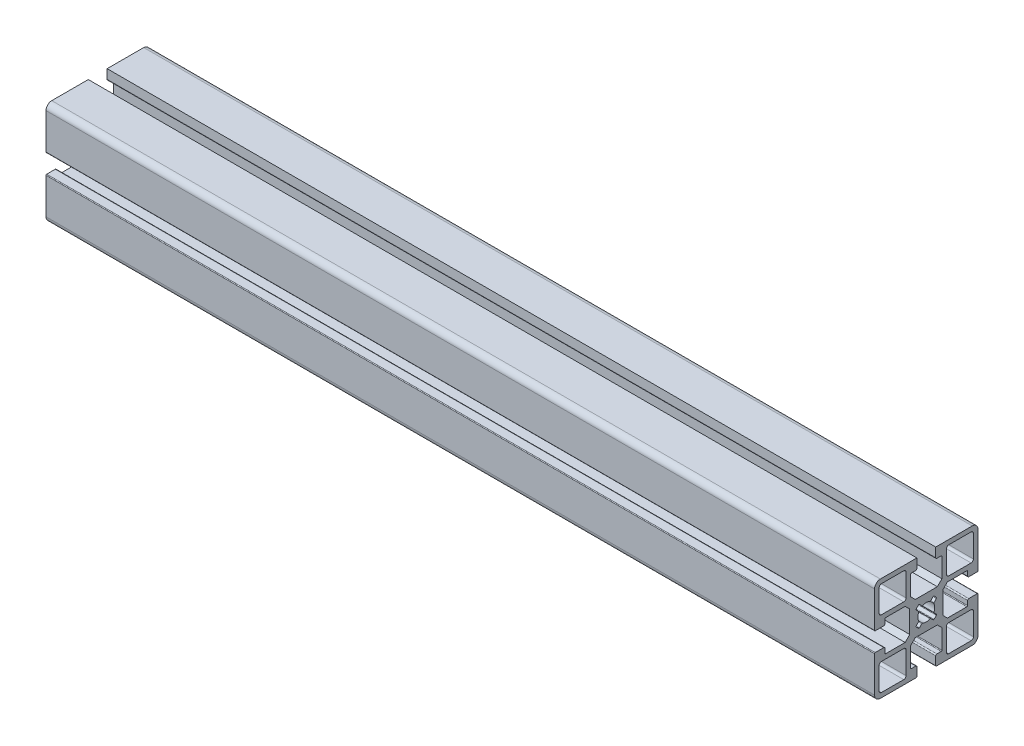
from build123d import *

# Parameters (mm, degrees)
F_45_SARJA_1_0022_45X45_L_1_DEPTH = 360.5
M8_TAPPED_HOLE1_D                 = 6.8
M8_TAPPED_HOLE1_DEPTH             = 14.4
M8_TAPPED_HOLE1_CSINK_D           = 8.05
M8_TAPPED_HOLE1_CSINK_ANGLE       = 90
M8_TAPPED_HOLE1_TIP               = 2.042926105


with BuildPart() as part:
    # Model → 45-sarja 1.0022 45X45 L_1 (new body)
    with BuildSketch(Plane(origin=(-180.25, 0, 0), x_dir=(0, 0, -1), z_dir=(1, 0, 0))):
        with BuildLine():
            Line((-6.5, 18), (-4.6, 18))
            ThreePointArc((-4.6, 18), (-4.246446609, 18.146446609), (-4.1, 18.5))
            Line((-4.1, 18.5), (-4.1, 22.5))
            Line((-4.1, 22.5), (-20, 22.5))
            ThreePointArc((-20, 22.5), (-21.767766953, 21.767766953), (-22.5, 20))
            Line((-22.5, 20), (-22.5, 4.4))
            ThreePointArc((-22.5, 4.4), (-22.412132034, 4.187867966), (-22.2, 4.1))
            Line((-22.2, 4.1), (-18.5, 4.1))
            ThreePointArc((-18.5, 4.1), (-18.146446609, 4.246446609), (-18, 4.6))
            Line((-18, 4.6), (-18, 6.5))
            ThreePointArc((-18, 6.5), (-17.912132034, 6.712132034), (-17.7, 6.8))
            Line((-17.7, 6.8), (-9.2, 6.8))
            Line((-9.2, 6.8), (-7.2, 4.8))
            Line((-7.2, 4.8), (-7.2, -4.8))
            Line((-7.2, -4.8), (-9.2, -6.8))
            Line((-9.2, -6.8), (-17.7, -6.8))
            ThreePointArc((-17.7, -6.8), (-17.912132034, -6.712132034), (-18, -6.5))
            Line((-18, -6.5), (-18, -4.6))
            ThreePointArc((-18, -4.6), (-18.146446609, -4.246446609), (-18.5, -4.1))
            Line((-18.5, -4.1), (-22.2, -4.1))
            ThreePointArc((-22.2, -4.1), (-22.412132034, -4.187867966), (-22.5, -4.4))
            Line((-22.5, -4.4), (-22.5, -20))
            ThreePointArc((-22.5, -20), (-21.767766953, -21.767766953), (-20, -22.5))
            Line((-20, -22.5), (-4.4, -22.5))
            ThreePointArc((-4.4, -22.5), (-4.187867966, -22.412132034), (-4.1, -22.2))
            Line((-4.1, -22.2), (-4.1, -18.5))
            ThreePointArc((-4.1, -18.5), (-4.246446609, -18.146446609), (-4.6, -18))
            Line((-4.6, -18), (-6.5, -18))
            ThreePointArc((-6.5, -18), (-6.712132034, -17.912132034), (-6.8, -17.7))
            Line((-6.8, -17.7), (-6.8, -9.2))
            Line((-6.8, -9.2), (-4.8, -7.2))
            Line((-4.8, -7.2), (4.8, -7.2))
            Line((4.8, -7.2), (6.8, -9.2))
            Line((6.8, -9.2), (6.8, -17.7))
            ThreePointArc((6.8, -17.7), (6.712132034, -17.912132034), (6.5, -18))
            Line((6.5, -18), (4.6, -18))
            ThreePointArc((4.6, -18), (4.246446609, -18.146446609), (4.1, -18.5))
            Line((4.1, -18.5), (4.1, -22.2))
            ThreePointArc((4.1, -22.2), (4.187867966, -22.412132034), (4.4, -22.5))
            Line((4.4, -22.5), (20, -22.5))
            ThreePointArc((20, -22.5), (21.767766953, -21.767766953), (22.5, -20))
            Line((22.5, -20), (22.5, -4.4))
            ThreePointArc((22.5, -4.4), (22.412132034, -4.187867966), (22.2, -4.1))
            Line((22.2, -4.1), (18.5, -4.1))
            ThreePointArc((18.5, -4.1), (18.146446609, -4.246446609), (18, -4.6))
            Line((18, -4.6), (18, -6.5))
            ThreePointArc((18, -6.5), (17.912132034, -6.712132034), (17.7, -6.8))
            Line((17.7, -6.8), (9.2, -6.8))
            Line((9.2, -6.8), (7.2, -4.8))
            Line((7.2, -4.8), (7.2, 4.8))
            Line((7.2, 4.8), (9.2, 6.8))
            Line((9.2, 6.8), (17.7, 6.8))
            ThreePointArc((17.7, 6.8), (17.912132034, 6.712132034), (18, 6.5))
            Line((18, 6.5), (18, 4.6))
            ThreePointArc((18, 4.6), (18.146446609, 4.246446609), (18.5, 4.1))
            Line((18.5, 4.1), (22.2, 4.1))
            ThreePointArc((22.2, 4.1), (22.412132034, 4.187867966), (22.5, 4.4))
            Line((22.5, 4.4), (22.5, 20))
            ThreePointArc((22.5, 20), (21.767766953, 21.767766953), (20, 22.5))
            Line((20, 22.5), (4.1, 22.5))
            Line((4.1, 22.5), (4.1, 18.5))
            ThreePointArc((4.1, 18.5), (4.246446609, 18.146446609), (4.6, 18))
            Line((4.6, 18), (6.5, 18))
            ThreePointArc((6.5, 18), (6.712132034, 17.912132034), (6.8, 17.7))
            Line((6.8, 17.7), (6.8, 9.2))
            Line((6.8, 9.2), (4.8, 7.2))
            Line((4.8, 7.2), (-4.8, 7.2))
            Line((-4.8, 7.2), (-6.8, 9.2))
            Line((-6.8, 9.2), (-6.8, 17.7))
            ThreePointArc((-6.8, 17.7), (-6.712132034, 17.912132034), (-6.5, 18))
        make_face()
        with BuildLine():
            Line((19.5, 20.5), (9.8, 20.5))
            ThreePointArc((9.8, 20.5), (9.092893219, 20.207106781), (8.8, 19.5))
            Line((8.8, 19.5), (8.8, 9.8))
            ThreePointArc((8.8, 9.8), (9.092893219, 9.092893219), (9.8, 8.8))
            Line((9.8, 8.8), (19.5, 8.8))
            ThreePointArc((19.5, 8.8), (20.207106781, 9.092893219), (20.5, 9.8))
            Line((20.5, 9.8), (20.5, 19.5))
            ThreePointArc((20.5, 19.5), (20.207106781, 20.207106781), (19.5, 20.5))
        make_face(mode=Mode.SUBTRACT)
        with BuildLine():
            Line((-9.8, 20.5), (-19.5, 20.5))
            ThreePointArc((-19.5, 20.5), (-20.207106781, 20.207106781), (-20.5, 19.5))
            Line((-20.5, 19.5), (-20.5, 9.8))
            ThreePointArc((-20.5, 9.8), (-20.207106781, 9.092893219), (-19.5, 8.8))
            Line((-19.5, 8.8), (-9.8, 8.8))
            ThreePointArc((-9.8, 8.8), (-9.092893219, 9.092893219), (-8.8, 9.8))
            Line((-8.8, 9.8), (-8.8, 19.5))
            ThreePointArc((-8.8, 19.5), (-9.092893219, 20.207106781), (-9.8, 20.5))
        make_face(mode=Mode.SUBTRACT)
        with BuildLine():
            Line((3.363290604, 1.949077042), (4.384062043, 2.969848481))
            ThreePointArc((4.384062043, 2.969848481), (4.471930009, 3.181980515), (4.384062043, 3.39411255))
            Line((4.384062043, 3.39411255), (3.39411255, 4.384062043))
            ThreePointArc((3.39411255, 4.384062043), (3.181980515, 4.471930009), (2.969848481, 4.384062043))
            Line((2.969848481, 4.384062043), (1.949077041, 3.363290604))
            ThreePointArc((1.949077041, 3.363290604), (1.786690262, 3.279575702), (1.605854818, 3.30557942))
            ThreePointArc((1.605854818, 3.30557942), (0, 3.675), (-1.605854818, 3.30557942))
            ThreePointArc((-1.605854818, 3.30557942), (-1.786690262, 3.279575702), (-1.949077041, 3.363290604))
            Line((-1.949077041, 3.363290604), (-2.969848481, 4.384062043))
            ThreePointArc((-2.969848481, 4.384062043), (-3.181980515, 4.471930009), (-3.39411255, 4.384062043))
            Line((-3.39411255, 4.384062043), (-4.384062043, 3.39411255))
            ThreePointArc((-4.384062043, 3.39411255), (-4.471930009, 3.181980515), (-4.384062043, 2.969848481))
            Line((-4.384062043, 2.969848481), (-3.363290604, 1.949077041))
            ThreePointArc((-3.363290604, 1.949077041), (-3.279575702, 1.786690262), (-3.30557942, 1.605854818))
            ThreePointArc((-3.30557942, 1.605854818), (-3.675, 0), (-3.30557942, -1.605854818))
            ThreePointArc((-3.30557942, -1.605854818), (-3.279575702, -1.786690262), (-3.363290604, -1.949077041))
            Line((-3.363290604, -1.949077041), (-4.384062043, -2.969848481))
            ThreePointArc((-4.384062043, -2.969848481), (-4.471930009, -3.181980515), (-4.384062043, -3.39411255))
            Line((-4.384062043, -3.39411255), (-3.39411255, -4.384062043))
            ThreePointArc((-3.39411255, -4.384062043), (-3.181980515, -4.471930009), (-2.969848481, -4.384062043))
            Line((-2.969848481, -4.384062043), (-1.949077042, -3.363290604))
            ThreePointArc((-1.949077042, -3.363290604), (-1.786690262, -3.279575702), (-1.605854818, -3.30557942))
            ThreePointArc((-1.605854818, -3.30557942), (0, -3.675), (1.605854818, -3.30557942))
            ThreePointArc((1.605854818, -3.30557942), (1.786690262, -3.279575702), (1.949077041, -3.363290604))
            Line((1.949077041, -3.363290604), (2.969848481, -4.384062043))
            ThreePointArc((2.969848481, -4.384062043), (3.181980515, -4.471930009), (3.39411255, -4.384062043))
            Line((3.39411255, -4.384062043), (4.384062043, -3.39411255))
            ThreePointArc((4.384062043, -3.39411255), (4.471930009, -3.181980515), (4.384062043, -2.969848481))
            Line((4.384062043, -2.969848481), (3.363290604, -1.949077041))
            ThreePointArc((3.363290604, -1.949077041), (3.279575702, -1.786690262), (3.30557942, -1.605854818))
            ThreePointArc((3.30557942, -1.605854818), (3.675, 0), (3.30557942, 1.605854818))
            ThreePointArc((3.30557942, 1.605854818), (3.279575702, 1.786690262), (3.363290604, 1.949077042))
        make_face(mode=Mode.SUBTRACT)
        with BuildLine():
            Line((19.5, -8.8), (9.8, -8.8))
            ThreePointArc((9.8, -8.8), (9.092893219, -9.092893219), (8.8, -9.8))
            Line((8.8, -9.8), (8.8, -19.5))
            ThreePointArc((8.8, -19.5), (9.092893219, -20.207106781), (9.8, -20.5))
            Line((9.8, -20.5), (19.5, -20.5))
            ThreePointArc((19.5, -20.5), (20.207106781, -20.207106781), (20.5, -19.5))
            Line((20.5, -19.5), (20.5, -9.8))
            ThreePointArc((20.5, -9.8), (20.207106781, -9.092893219), (19.5, -8.8))
        make_face(mode=Mode.SUBTRACT)
        with BuildLine():
            Line((-19.5, -20.5), (-9.8, -20.5))
            ThreePointArc((-9.8, -20.5), (-9.092893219, -20.207106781), (-8.8, -19.5))
            Line((-8.8, -19.5), (-8.8, -9.8))
            ThreePointArc((-8.8, -9.8), (-9.092893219, -9.092893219), (-9.8, -8.8))
            Line((-9.8, -8.8), (-19.5, -8.8))
            ThreePointArc((-19.5, -8.8), (-20.207106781, -9.092893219), (-20.5, -9.8))
            Line((-20.5, -9.8), (-20.5, -19.5))
            ThreePointArc((-20.5, -19.5), (-20.207106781, -20.207106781), (-19.5, -20.5))
        make_face(mode=Mode.SUBTRACT)
    extrude(amount=F_45_SARJA_1_0022_45X45_L_1_DEPTH)

    # M8 Tapped Hole1
    with Locations(Plane(origin=(0, 7.2, 0), x_dir=(1, 0, 0), z_dir=(0, 1, 0))):
        with Locations((-157.75, 0), (157.75, 0)):
            CounterSinkHole(M8_TAPPED_HOLE1_D / 2, M8_TAPPED_HOLE1_CSINK_D / 2, depth=M8_TAPPED_HOLE1_DEPTH, counter_sink_angle=M8_TAPPED_HOLE1_CSINK_ANGLE)
            with Locations((0, 0, -(M8_TAPPED_HOLE1_DEPTH + M8_TAPPED_HOLE1_TIP / 2))):  # 118° drill point
                Cone(0, M8_TAPPED_HOLE1_D / 2, M8_TAPPED_HOLE1_TIP, mode=Mode.SUBTRACT)


solid = part.part
